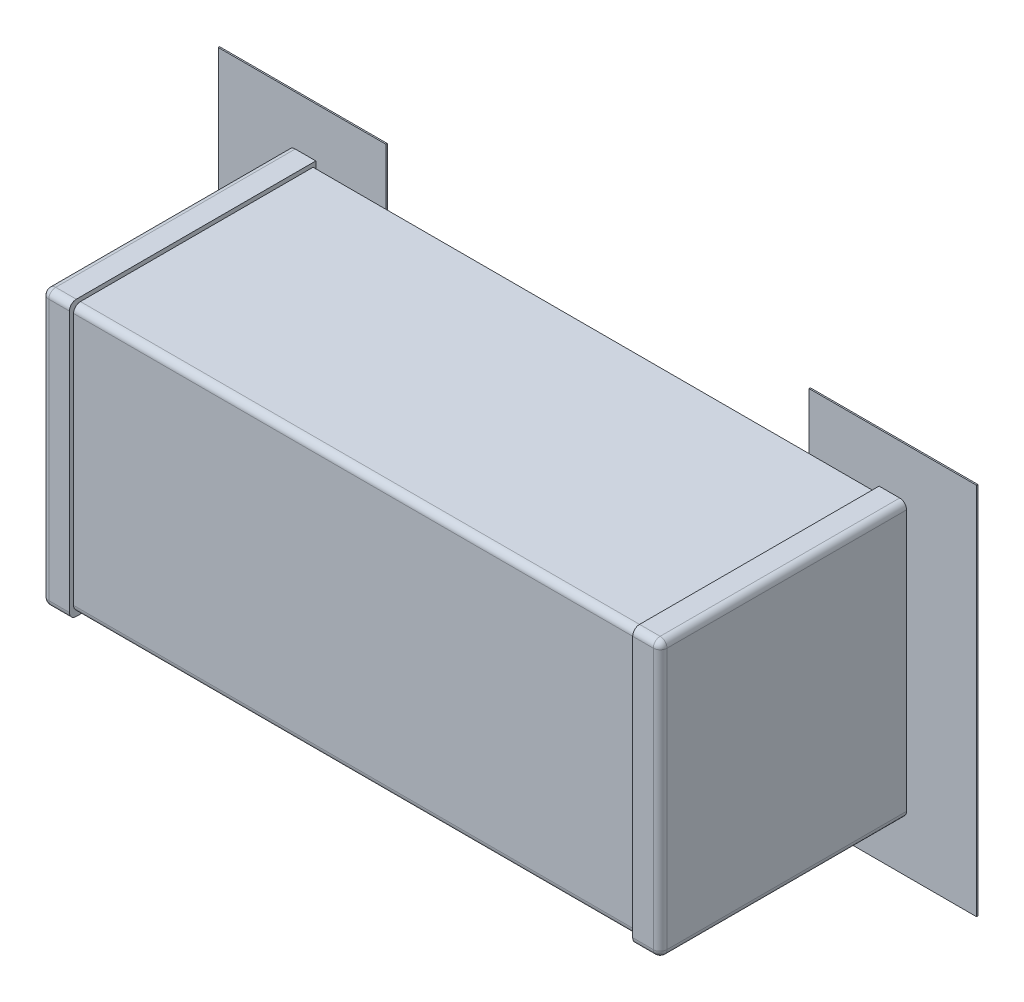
ISO-10303-21;
HEADER;
FILE_DESCRIPTION(('STEP AP214'),'2;1');
FILE_NAME('part.step','',(''),(''),'','','');
FILE_SCHEMA(('AUTOMOTIVE_DESIGN { 1 0 10303 214 1 1 1 1 }'));
ENDSEC;
DATA;
#1=APPLICATION_CONTEXT('core data for automotive mechanical design processes');
#2=APPLICATION_PROTOCOL_DEFINITION('international standard','automotive_design',2000,#1);
#3=PRODUCT_CONTEXT('',#1,'mechanical');
#4=PRODUCT('Part','Part','',(#3));
#5=PRODUCT_RELATED_PRODUCT_CATEGORY('part','',(#4));
#6=PRODUCT_DEFINITION_FORMATION('','',#4);
#7=PRODUCT_DEFINITION_CONTEXT('part definition',#1,'design');
#8=PRODUCT_DEFINITION('design','',#6,#7);
#9=PRODUCT_DEFINITION_SHAPE('','',#8);
#10=(LENGTH_UNIT() NAMED_UNIT(*) SI_UNIT(.MILLI.,.METRE.));
#11=(NAMED_UNIT(*) PLANE_ANGLE_UNIT() SI_UNIT($,.RADIAN.));
#12=(NAMED_UNIT(*) SI_UNIT($,.STERADIAN.) SOLID_ANGLE_UNIT());
#13=UNCERTAINTY_MEASURE_WITH_UNIT(LENGTH_MEASURE(1.E-05),#10,'distance_accuracy_value','');
#14=(GEOMETRIC_REPRESENTATION_CONTEXT(3) GLOBAL_UNCERTAINTY_ASSIGNED_CONTEXT((#13)) GLOBAL_UNIT_ASSIGNED_CONTEXT((#10,
#11,#12)) REPRESENTATION_CONTEXT('',''));
#15=CARTESIAN_POINT('',(0.,0.,0.));
#16=DIRECTION('',(0.,0.,1.));
#17=DIRECTION('',(1.,0.,0.));
#18=AXIS2_PLACEMENT_3D('',#15,#16,#17);
#19=CARTESIAN_POINT('',(0.,0.,0.0762));
#20=DIRECTION('',(0.,0.,1.));
#21=DIRECTION('',(1.,0.,0.));
#22=AXIS2_PLACEMENT_3D('',#19,#20,#21);
#23=PLANE('',#22);
#24=DIRECTION('',(1.,0.,0.));
#25=VECTOR('',#24,1.);
#26=CARTESIAN_POINT('',(2.75999999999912,1.35999999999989,0.0762));
#27=LINE('',#26,#25);
#28=CARTESIAN_POINT('',(2.75999999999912,1.35999999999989,0.0762));
#29=VERTEX_POINT('',#28);
#30=CARTESIAN_POINT('',(1.53999999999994,1.35999999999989,0.0762));
#31=VERTEX_POINT('',#30);
#32=EDGE_CURVE('E735',#29,#31,#27,.F.);
#33=ORIENTED_EDGE('',*,*,#32,.F.);
#34=DIRECTION('',(0.,1.,0.));
#35=VECTOR('',#34,1.);
#36=CARTESIAN_POINT('',(2.75999999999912,-1.35999999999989,0.0762));
#37=LINE('',#36,#35);
#38=CARTESIAN_POINT('',(2.75999999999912,-1.35999999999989,0.0762));
#39=VERTEX_POINT('',#38);
#40=EDGE_CURVE('E573',#39,#29,#37,.T.);
#41=ORIENTED_EDGE('',*,*,#40,.F.);
#42=DIRECTION('',(1.,0.,0.));
#43=VECTOR('',#42,1.);
#44=CARTESIAN_POINT('',(0.,-1.35999999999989,0.0762));
#45=LINE('',#44,#43);
#46=CARTESIAN_POINT('',(1.53999999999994,-1.35999999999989,0.0762));
#47=VERTEX_POINT('',#46);
#48=EDGE_CURVE('E252',#47,#39,#45,.T.);
#49=ORIENTED_EDGE('',*,*,#48,.F.);
#50=DIRECTION('',(0.,1.,0.));
#51=VECTOR('',#50,1.);
#52=CARTESIAN_POINT('',(1.53999999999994,1.35999999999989,0.0762));
#53=LINE('',#52,#51);
#54=EDGE_CURVE('E725',#31,#47,#53,.F.);
#55=ORIENTED_EDGE('',*,*,#54,.F.);
#56=EDGE_LOOP('',(#33,#41,#49,#55));
#57=FACE_BOUND('',#56,.T.);
#58=ADVANCED_FACE('F16',(#57),#23,.F.);
#59=CARTESIAN_POINT('',(0.,0.,0.0762));
#60=DIRECTION('',(0.,0.,1.));
#61=DIRECTION('',(1.,0.,0.));
#62=AXIS2_PLACEMENT_3D('',#59,#60,#61);
#63=PLANE('',#62);
#64=DIRECTION('',(1.,0.,0.));
#65=VECTOR('',#64,1.);
#66=CARTESIAN_POINT('',(-1.53999999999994,1.35999999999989,0.0762));
#67=LINE('',#66,#65);
#68=CARTESIAN_POINT('',(-1.53999999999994,1.35999999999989,0.0762));
#69=VERTEX_POINT('',#68);
#70=CARTESIAN_POINT('',(-2.75999999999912,1.35999999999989,0.0762));
#71=VERTEX_POINT('',#70);
#72=EDGE_CURVE('E256',#69,#71,#67,.F.);
#73=ORIENTED_EDGE('',*,*,#72,.F.);
#74=DIRECTION('',(0.,1.,0.));
#75=VECTOR('',#74,1.);
#76=CARTESIAN_POINT('',(-1.53999999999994,-1.35999999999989,0.0762));
#77=LINE('',#76,#75);
#78=CARTESIAN_POINT('',(-1.53999999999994,-1.35999999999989,0.0762));
#79=VERTEX_POINT('',#78);
#80=EDGE_CURVE('E106',#79,#69,#77,.T.);
#81=ORIENTED_EDGE('',*,*,#80,.F.);
#82=DIRECTION('',(1.,0.,0.));
#83=VECTOR('',#82,1.);
#84=CARTESIAN_POINT('',(0.,-1.35999999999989,0.0762));
#85=LINE('',#84,#83);
#86=CARTESIAN_POINT('',(-2.75999999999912,-1.35999999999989,0.0762));
#87=VERTEX_POINT('',#86);
#88=EDGE_CURVE('E242',#87,#79,#85,.T.);
#89=ORIENTED_EDGE('',*,*,#88,.F.);
#90=DIRECTION('',(0.,1.,0.));
#91=VECTOR('',#90,1.);
#92=CARTESIAN_POINT('',(-2.75999999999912,1.35999999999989,0.0762));
#93=LINE('',#92,#91);
#94=EDGE_CURVE('E263',#71,#87,#93,.F.);
#95=ORIENTED_EDGE('',*,*,#94,.F.);
#96=EDGE_LOOP('',(#73,#81,#89,#95));
#97=FACE_BOUND('',#96,.T.);
#98=ADVANCED_FACE('F255',(#97),#63,.F.);
#99=CARTESIAN_POINT('',(2.20000000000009,0.95000000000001,1.82959999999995));
#100=DIRECTION('',(0.,0.707106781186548,0.707106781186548));
#101=DIRECTION('',(1.,0.,0.));
#102=AXIS2_PLACEMENT_3D('',#99,#100,#101);
#103=SPHERICAL_SURFACE('',#102,0.0500000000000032);
#104=CARTESIAN_POINT('',(2.20000000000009,0.95000000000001,1.82959999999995));
#105=DIRECTION('',(-1.,0.,0.));
#106=DIRECTION('',(0.,0.,1.));
#107=AXIS2_PLACEMENT_3D('',#104,#105,#106);
#108=CIRCLE('',#107,0.0500000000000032);
#109=CARTESIAN_POINT('',(2.20000000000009,0.95000000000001,1.87959999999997));
#110=VERTEX_POINT('',#109);
#111=CARTESIAN_POINT('',(2.20000000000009,0.985355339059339,1.86495533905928));
#112=VERTEX_POINT('',#111);
#113=EDGE_CURVE('E585',#110,#112,#108,.T.);
#114=ORIENTED_EDGE('',*,*,#113,.F.);
#115=CARTESIAN_POINT('',(2.20000000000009,0.95000000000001,1.82959999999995));
#116=DIRECTION('',(0.,1.,0.));
#117=DIRECTION('',(0.,0.,1.));
#118=AXIS2_PLACEMENT_3D('',#115,#116,#117);
#119=CIRCLE('',#118,0.0500000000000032);
#120=CARTESIAN_POINT('',(2.24999999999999,0.95000000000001,1.82959999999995));
#121=VERTEX_POINT('',#120);
#122=EDGE_CURVE('E19',#121,#110,#119,.F.);
#123=ORIENTED_EDGE('',*,*,#122,.F.);
#124=CARTESIAN_POINT('',(2.20000000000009,0.95000000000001,1.82959999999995));
#125=DIRECTION('',(0.,0.,-1.));
#126=DIRECTION('',(-1.,0.,0.));
#127=AXIS2_PLACEMENT_3D('',#124,#125,#126);
#128=CIRCLE('',#127,0.0500000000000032);
#129=CARTESIAN_POINT('',(2.20000000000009,1.00000000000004,1.82959999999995));
#130=VERTEX_POINT('',#129);
#131=EDGE_CURVE('E568',#130,#121,#128,.T.);
#132=ORIENTED_EDGE('',*,*,#131,.F.);
#133=CARTESIAN_POINT('',(2.20000000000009,0.95000000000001,1.82959999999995));
#134=DIRECTION('',(-1.,0.,0.));
#135=DIRECTION('',(0.,0.,1.));
#136=AXIS2_PLACEMENT_3D('',#133,#134,#135);
#137=CIRCLE('',#136,0.0500000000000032);
#138=EDGE_CURVE('E586',#112,#130,#137,.T.);
#139=ORIENTED_EDGE('',*,*,#138,.F.);
#140=EDGE_LOOP('',(#114,#123,#132,#139));
#141=FACE_BOUND('',#140,.T.);
#142=ADVANCED_FACE('F348',(#141),#103,.T.);
#143=CARTESIAN_POINT('',(2.20000000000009,-4.90579199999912,1.82959999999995));
#144=DIRECTION('',(0.,1.,0.));
#145=DIRECTION('',(0.,0.,1.));
#146=AXIS2_PLACEMENT_3D('',#143,#144,#145);
#147=CYLINDRICAL_SURFACE('',#146,0.0500000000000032);
#148=CARTESIAN_POINT('',(2.20000000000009,-0.95000000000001,1.82959999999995));
#149=DIRECTION('',(0.,1.,0.));
#150=DIRECTION('',(0.,0.,1.));
#151=AXIS2_PLACEMENT_3D('',#148,#149,#150);
#152=CIRCLE('',#151,0.0500000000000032);
#153=CARTESIAN_POINT('',(2.24999999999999,-0.95000000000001,1.82959999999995));
#154=VERTEX_POINT('',#153);
#155=CARTESIAN_POINT('',(2.23535533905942,-0.95000000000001,1.86495533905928));
#156=VERTEX_POINT('',#155);
#157=EDGE_CURVE('E345',#154,#156,#152,.F.);
#158=ORIENTED_EDGE('',*,*,#157,.F.);
#159=DIRECTION('',(0.,1.,0.));
#160=VECTOR('',#159,1.);
#161=CARTESIAN_POINT('',(2.24999999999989,-1.00000000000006,1.82959999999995));
#162=LINE('',#161,#160);
#163=EDGE_CURVE('E582',#121,#154,#162,.F.);
#164=ORIENTED_EDGE('',*,*,#163,.F.);
#165=ORIENTED_EDGE('',*,*,#122,.T.);
#166=DIRECTION('',(0.,1.,0.));
#167=VECTOR('',#166,1.);
#168=CARTESIAN_POINT('',(2.20000000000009,0.,1.8796));
#169=LINE('',#168,#167);
#170=CARTESIAN_POINT('',(2.20000000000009,-0.950000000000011,1.87959999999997));
#171=VERTEX_POINT('',#170);
#172=EDGE_CURVE('E340',#171,#110,#169,.T.);
#173=ORIENTED_EDGE('',*,*,#172,.F.);
#174=CARTESIAN_POINT('',(2.20000000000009,-0.95000000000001,1.82959999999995));
#175=DIRECTION('',(0.,-1.,0.));
#176=DIRECTION('',(0.707106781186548,0.,0.707106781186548));
#177=AXIS2_PLACEMENT_3D('',#174,#175,#176);
#178=CIRCLE('',#177,0.0500000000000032);
#179=EDGE_CURVE('E342',#156,#171,#178,.T.);
#180=ORIENTED_EDGE('',*,*,#179,.F.);
#181=EDGE_LOOP('',(#158,#164,#165,#173,#180));
#182=FACE_BOUND('',#181,.T.);
#183=ADVANCED_FACE('F334',(#182),#147,.T.);
#184=CARTESIAN_POINT('',(2.20000000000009,-0.95000000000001,1.82959999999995));
#185=DIRECTION('',(0.707106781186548,0.,0.707106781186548));
#186=DIRECTION('',(0.,-1.,0.));
#187=AXIS2_PLACEMENT_3D('',#184,#185,#186);
#188=SPHERICAL_SURFACE('',#187,0.0500000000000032);
#189=ORIENTED_EDGE('',*,*,#179,.T.);
#190=CARTESIAN_POINT('',(2.20000000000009,-0.95000000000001,1.82959999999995));
#191=DIRECTION('',(1.,0.,0.));
#192=DIRECTION('',(0.,0.,-1.));
#193=AXIS2_PLACEMENT_3D('',#190,#191,#192);
#194=CIRCLE('',#193,0.0500000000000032);
#195=CARTESIAN_POINT('',(2.20000000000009,-1.00000000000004,1.82959999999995));
#196=VERTEX_POINT('',#195);
#197=EDGE_CURVE('E537',#196,#171,#194,.F.);
#198=ORIENTED_EDGE('',*,*,#197,.F.);
#199=CARTESIAN_POINT('',(2.20000000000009,-0.95000000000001,1.82959999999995));
#200=DIRECTION('',(0.,0.,-1.));
#201=DIRECTION('',(-1.,0.,0.));
#202=AXIS2_PLACEMENT_3D('',#199,#200,#201);
#203=CIRCLE('',#202,0.0500000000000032);
#204=EDGE_CURVE('E571',#154,#196,#203,.T.);
#205=ORIENTED_EDGE('',*,*,#204,.F.);
#206=ORIENTED_EDGE('',*,*,#157,.T.);
#207=EDGE_LOOP('',(#189,#198,#205,#206));
#208=FACE_BOUND('',#207,.T.);
#209=ADVANCED_FACE('F329',(#208),#188,.T.);
#210=CARTESIAN_POINT('',(2.20000000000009,-0.95000000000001,4.23051224));
#211=DIRECTION('',(0.,0.,-1.));
#212=DIRECTION('',(-1.,0.,0.));
#213=AXIS2_PLACEMENT_3D('',#210,#211,#212);
#214=CYLINDRICAL_SURFACE('',#213,0.0500000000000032);
#215=ORIENTED_EDGE('',*,*,#204,.T.);
#216=DIRECTION('',(0.,0.,-1.));
#217=VECTOR('',#216,1.);
#218=CARTESIAN_POINT('',(2.20000000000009,-1.00000000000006,0.0762));
#219=LINE('',#218,#217);
#220=CARTESIAN_POINT('',(2.20000000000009,-1.00000000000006,0.0862000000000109));
#221=VERTEX_POINT('',#220);
#222=EDGE_CURVE('E532',#221,#196,#219,.F.);
#223=ORIENTED_EDGE('',*,*,#222,.F.);
#224=CARTESIAN_POINT('',(2.20000000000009,-0.95000000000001,0.0862000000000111));
#225=DIRECTION('',(0.,0.,-1.));
#226=DIRECTION('',(-1.,0.,0.));
#227=AXIS2_PLACEMENT_3D('',#224,#225,#226);
#228=CIRCLE('',#227,0.0500000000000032);
#229=CARTESIAN_POINT('',(2.24999999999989,-0.95000000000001,0.0862000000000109));
#230=VERTEX_POINT('',#229);
#231=EDGE_CURVE('E344',#221,#230,#228,.F.);
#232=ORIENTED_EDGE('',*,*,#231,.T.);
#233=DIRECTION('',(0.,0.,-1.));
#234=VECTOR('',#233,1.);
#235=CARTESIAN_POINT('',(2.24999999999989,-0.95000000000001,0.0762));
#236=LINE('',#235,#234);
#237=EDGE_CURVE('E570',#154,#230,#236,.T.);
#238=ORIENTED_EDGE('',*,*,#237,.F.);
#239=EDGE_LOOP('',(#215,#223,#232,#238));
#240=FACE_BOUND('',#239,.T.);
#241=ADVANCED_FACE('F325',(#240),#214,.T.);
#242=CARTESIAN_POINT('',(2.75999999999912,-1.35999999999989,0.0762));
#243=DIRECTION('',(1.,0.,0.));
#244=DIRECTION('',(0.,0.,-1.));
#245=AXIS2_PLACEMENT_3D('',#242,#243,#244);
#246=PLANE('',#245);
#247=DIRECTION('',(0.,0.,-1.));
#248=VECTOR('',#247,1.);
#249=CARTESIAN_POINT('',(2.75999999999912,-1.35999999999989,0.0762));
#250=LINE('',#249,#248);
#251=CARTESIAN_POINT('',(2.75999999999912,-1.35999999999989,0.0862000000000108));
#252=VERTEX_POINT('',#251);
#253=EDGE_CURVE('E721',#39,#252,#250,.F.);
#254=ORIENTED_EDGE('',*,*,#253,.F.);
#255=ORIENTED_EDGE('',*,*,#40,.T.);
#256=DIRECTION('',(0.,0.,1.));
#257=VECTOR('',#256,1.);
#258=CARTESIAN_POINT('',(2.75999999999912,1.35999999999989,0.0762));
#259=LINE('',#258,#257);
#260=CARTESIAN_POINT('',(2.75999999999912,1.35999999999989,0.0862000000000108));
#261=VERTEX_POINT('',#260);
#262=EDGE_CURVE('E737',#261,#29,#259,.F.);
#263=ORIENTED_EDGE('',*,*,#262,.F.);
#264=DIRECTION('',(0.,1.,0.));
#265=VECTOR('',#264,1.);
#266=CARTESIAN_POINT('',(2.75999999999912,0.,0.0862000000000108));
#267=LINE('',#266,#265);
#268=EDGE_CURVE('E530',#252,#261,#267,.T.);
#269=ORIENTED_EDGE('',*,*,#268,.F.);
#270=EDGE_LOOP('',(#254,#255,#263,#269));
#271=FACE_BOUND('',#270,.T.);
#272=ADVANCED_FACE('F321',(#271),#246,.T.);
#273=CARTESIAN_POINT('',(2.75999999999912,1.35999999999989,0.0762));
#274=DIRECTION('',(0.,1.,0.));
#275=DIRECTION('',(0.,0.,1.));
#276=AXIS2_PLACEMENT_3D('',#273,#274,#275);
#277=PLANE('',#276);
#278=ORIENTED_EDGE('',*,*,#262,.T.);
#279=ORIENTED_EDGE('',*,*,#32,.T.);
#280=DIRECTION('',(0.,0.,1.));
#281=VECTOR('',#280,1.);
#282=CARTESIAN_POINT('',(1.53999999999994,1.35999999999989,0.0762));
#283=LINE('',#282,#281);
#284=CARTESIAN_POINT('',(1.53999999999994,1.35999999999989,0.0862000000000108));
#285=VERTEX_POINT('',#284);
#286=EDGE_CURVE('E732',#285,#31,#283,.F.);
#287=ORIENTED_EDGE('',*,*,#286,.F.);
#288=DIRECTION('',(1.,0.,0.));
#289=VECTOR('',#288,1.);
#290=CARTESIAN_POINT('',(0.,1.35999999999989,0.0862000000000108));
#291=LINE('',#290,#289);
#292=EDGE_CURVE('E528',#261,#285,#291,.F.);
#293=ORIENTED_EDGE('',*,*,#292,.F.);
#294=EDGE_LOOP('',(#278,#279,#287,#293));
#295=FACE_BOUND('',#294,.T.);
#296=ADVANCED_FACE('F317',(#295),#277,.T.);
#297=CARTESIAN_POINT('',(1.53999999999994,1.35999999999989,0.0762));
#298=DIRECTION('',(-1.,0.,0.));
#299=DIRECTION('',(0.,0.,1.));
#300=AXIS2_PLACEMENT_3D('',#297,#298,#299);
#301=PLANE('',#300);
#302=ORIENTED_EDGE('',*,*,#286,.T.);
#303=ORIENTED_EDGE('',*,*,#54,.T.);
#304=DIRECTION('',(0.,0.,-1.));
#305=VECTOR('',#304,1.);
#306=CARTESIAN_POINT('',(1.53999999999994,-1.35999999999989,0.0762));
#307=LINE('',#306,#305);
#308=CARTESIAN_POINT('',(1.53999999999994,-1.35999999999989,0.0862000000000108));
#309=VERTEX_POINT('',#308);
#310=EDGE_CURVE('E717',#309,#47,#307,.T.);
#311=ORIENTED_EDGE('',*,*,#310,.F.);
#312=DIRECTION('',(0.,1.,0.));
#313=VECTOR('',#312,1.);
#314=CARTESIAN_POINT('',(1.53999999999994,0.,0.0862000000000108));
#315=LINE('',#314,#313);
#316=EDGE_CURVE('E526',#285,#309,#315,.F.);
#317=ORIENTED_EDGE('',*,*,#316,.F.);
#318=EDGE_LOOP('',(#302,#303,#311,#317));
#319=FACE_BOUND('',#318,.T.);
#320=ADVANCED_FACE('F313',(#319),#301,.T.);
#321=CARTESIAN_POINT('',(1.53999999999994,-1.35999999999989,0.0762));
#322=DIRECTION('',(0.,-1.,0.));
#323=DIRECTION('',(0.,0.,-1.));
#324=AXIS2_PLACEMENT_3D('',#321,#322,#323);
#325=PLANE('',#324);
#326=ORIENTED_EDGE('',*,*,#310,.T.);
#327=ORIENTED_EDGE('',*,*,#48,.T.);
#328=ORIENTED_EDGE('',*,*,#253,.T.);
#329=DIRECTION('',(1.,0.,0.));
#330=VECTOR('',#329,1.);
#331=CARTESIAN_POINT('',(0.,-1.35999999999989,0.0862000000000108));
#332=LINE('',#331,#330);
#333=EDGE_CURVE('E521',#309,#252,#332,.T.);
#334=ORIENTED_EDGE('',*,*,#333,.F.);
#335=EDGE_LOOP('',(#326,#327,#328,#334));
#336=FACE_BOUND('',#335,.T.);
#337=ADVANCED_FACE('F309',(#336),#325,.T.);
#338=CARTESIAN_POINT('',(2.24999999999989,-1.00000000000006,0.0762));
#339=DIRECTION('',(1.,0.,0.));
#340=DIRECTION('',(0.,0.,-1.));
#341=AXIS2_PLACEMENT_3D('',#338,#339,#340);
#342=PLANE('',#341);
#343=DIRECTION('',(0.,1.,0.));
#344=VECTOR('',#343,1.);
#345=CARTESIAN_POINT('',(2.24999999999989,0.,0.0862000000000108));
#346=LINE('',#345,#344);
#347=CARTESIAN_POINT('',(2.24999999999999,0.95000000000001,0.0862000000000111));
#348=VERTEX_POINT('',#347);
#349=EDGE_CURVE('E515',#348,#230,#346,.F.);
#350=ORIENTED_EDGE('',*,*,#349,.F.);
#351=DIRECTION('',(0.,0.,-1.));
#352=VECTOR('',#351,1.);
#353=CARTESIAN_POINT('',(2.25000000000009,0.95000000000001,4.23051224));
#354=LINE('',#353,#352);
#355=EDGE_CURVE('E567',#121,#348,#354,.T.);
#356=ORIENTED_EDGE('',*,*,#355,.F.);
#357=ORIENTED_EDGE('',*,*,#163,.T.);
#358=ORIENTED_EDGE('',*,*,#237,.T.);
#359=EDGE_LOOP('',(#350,#356,#357,#358));
#360=FACE_BOUND('',#359,.T.);
#361=ADVANCED_FACE('F305',(#360),#342,.T.);
#362=CARTESIAN_POINT('',(2.20000000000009,0.95000000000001,4.23051224));
#363=DIRECTION('',(0.,0.,-1.));
#364=DIRECTION('',(-1.,0.,0.));
#365=AXIS2_PLACEMENT_3D('',#362,#363,#364);
#366=CYLINDRICAL_SURFACE('',#365,0.0500000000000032);
#367=ORIENTED_EDGE('',*,*,#131,.T.);
#368=ORIENTED_EDGE('',*,*,#355,.T.);
#369=CARTESIAN_POINT('',(2.20000000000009,0.95000000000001,0.0862000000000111));
#370=DIRECTION('',(0.,0.,-1.));
#371=DIRECTION('',(-1.,0.,0.));
#372=AXIS2_PLACEMENT_3D('',#369,#370,#371);
#373=CIRCLE('',#372,0.0500000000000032);
#374=CARTESIAN_POINT('',(2.20000000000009,1.00000000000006,0.0862000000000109));
#375=VERTEX_POINT('',#374);
#376=EDGE_CURVE('E518',#375,#348,#373,.T.);
#377=ORIENTED_EDGE('',*,*,#376,.F.);
#378=DIRECTION('',(0.,0.,1.));
#379=VECTOR('',#378,1.);
#380=CARTESIAN_POINT('',(2.20000000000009,1.00000000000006,0.0762));
#381=LINE('',#380,#379);
#382=EDGE_CURVE('E505',#130,#375,#381,.F.);
#383=ORIENTED_EDGE('',*,*,#382,.F.);
#384=EDGE_LOOP('',(#367,#368,#377,#383));
#385=FACE_BOUND('',#384,.T.);
#386=ADVANCED_FACE('F301',(#385),#366,.T.);
#387=CARTESIAN_POINT('',(-2.20000000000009,-0.95000000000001,1.82959999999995));
#388=DIRECTION('',(0.,-0.707106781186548,0.707106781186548));
#389=DIRECTION('',(-1.,0.,0.));
#390=AXIS2_PLACEMENT_3D('',#387,#388,#389);
#391=SPHERICAL_SURFACE('',#390,0.0500000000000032);
#392=CARTESIAN_POINT('',(-2.20000000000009,-0.95000000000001,1.82959999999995));
#393=DIRECTION('',(1.,0.,0.));
#394=DIRECTION('',(0.,0.,-1.));
#395=AXIS2_PLACEMENT_3D('',#392,#393,#394);
#396=CIRCLE('',#395,0.0500000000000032);
#397=CARTESIAN_POINT('',(-2.20000000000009,-0.95000000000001,1.87959999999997));
#398=VERTEX_POINT('',#397);
#399=CARTESIAN_POINT('',(-2.20000000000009,-0.985355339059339,1.86495533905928));
#400=VERTEX_POINT('',#399);
#401=EDGE_CURVE('E540',#398,#400,#396,.T.);
#402=ORIENTED_EDGE('',*,*,#401,.F.);
#403=CARTESIAN_POINT('',(-2.20000000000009,-0.95000000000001,1.82959999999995));
#404=DIRECTION('',(0.,-1.,0.));
#405=DIRECTION('',(0.,0.,-1.));
#406=AXIS2_PLACEMENT_3D('',#403,#404,#405);
#407=CIRCLE('',#406,0.0500000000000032);
#408=CARTESIAN_POINT('',(-2.24999999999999,-0.95000000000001,1.82959999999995));
#409=VERTEX_POINT('',#408);
#410=EDGE_CURVE('E565',#409,#398,#407,.F.);
#411=ORIENTED_EDGE('',*,*,#410,.F.);
#412=CARTESIAN_POINT('',(-2.20000000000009,-0.95000000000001,1.82959999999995));
#413=DIRECTION('',(0.,0.,-1.));
#414=DIRECTION('',(-1.,0.,0.));
#415=AXIS2_PLACEMENT_3D('',#412,#413,#414);
#416=CIRCLE('',#415,0.0500000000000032);
#417=CARTESIAN_POINT('',(-2.20000000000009,-1.00000000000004,1.82959999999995));
#418=VERTEX_POINT('',#417);
#419=EDGE_CURVE('E549',#418,#409,#416,.T.);
#420=ORIENTED_EDGE('',*,*,#419,.F.);
#421=CARTESIAN_POINT('',(-2.20000000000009,-0.95000000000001,1.82959999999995));
#422=DIRECTION('',(1.,0.,0.));
#423=DIRECTION('',(0.,0.,-1.));
#424=AXIS2_PLACEMENT_3D('',#421,#422,#423);
#425=CIRCLE('',#424,0.0500000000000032);
#426=EDGE_CURVE('E281',#400,#418,#425,.T.);
#427=ORIENTED_EDGE('',*,*,#426,.F.);
#428=EDGE_LOOP('',(#402,#411,#420,#427));
#429=FACE_BOUND('',#428,.T.);
#430=ADVANCED_FACE('F297',(#429),#391,.T.);
#431=CARTESIAN_POINT('',(-2.20000000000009,4.90579199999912,1.82959999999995));
#432=DIRECTION('',(0.,-1.,0.));
#433=DIRECTION('',(0.,0.,-1.));
#434=AXIS2_PLACEMENT_3D('',#431,#432,#433);
#435=CYLINDRICAL_SURFACE('',#434,0.0500000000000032);
#436=CARTESIAN_POINT('',(-2.20000000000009,0.95000000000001,1.82959999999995));
#437=DIRECTION('',(0.,-1.,0.));
#438=DIRECTION('',(0.,0.,-1.));
#439=AXIS2_PLACEMENT_3D('',#436,#437,#438);
#440=CIRCLE('',#439,0.0500000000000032);
#441=CARTESIAN_POINT('',(-2.24999999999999,0.95000000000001,1.82959999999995));
#442=VERTEX_POINT('',#441);
#443=CARTESIAN_POINT('',(-2.20000000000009,0.95000000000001,1.87959999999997));
#444=VERTEX_POINT('',#443);
#445=EDGE_CURVE('E469',#442,#444,#440,.F.);
#446=ORIENTED_EDGE('',*,*,#445,.F.);
#447=DIRECTION('',(0.,1.,0.));
#448=VECTOR('',#447,1.);
#449=CARTESIAN_POINT('',(-2.24999999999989,1.00000000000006,1.82959999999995));
#450=LINE('',#449,#448);
#451=EDGE_CURVE('E265',#409,#442,#450,.T.);
#452=ORIENTED_EDGE('',*,*,#451,.F.);
#453=ORIENTED_EDGE('',*,*,#410,.T.);
#454=DIRECTION('',(0.,1.,0.));
#455=VECTOR('',#454,1.);
#456=CARTESIAN_POINT('',(-2.20000000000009,0.,1.8796));
#457=LINE('',#456,#455);
#458=EDGE_CURVE('E277',#444,#398,#457,.F.);
#459=ORIENTED_EDGE('',*,*,#458,.F.);
#460=EDGE_LOOP('',(#446,#452,#453,#459));
#461=FACE_BOUND('',#460,.T.);
#462=ADVANCED_FACE('F292',(#461),#435,.T.);
#463=CARTESIAN_POINT('',(-2.20000000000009,0.95000000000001,1.82959999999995));
#464=DIRECTION('',(-0.707106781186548,0.707106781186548,0.));
#465=DIRECTION('',(0.,0.,1.));
#466=AXIS2_PLACEMENT_3D('',#463,#464,#465);
#467=SPHERICAL_SURFACE('',#466,0.0500000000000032);
#468=ORIENTED_EDGE('',*,*,#445,.T.);
#469=CARTESIAN_POINT('',(-2.20000000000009,0.95000000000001,1.82959999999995));
#470=DIRECTION('',(-1.,0.,0.));
#471=DIRECTION('',(0.,0.,1.));
#472=AXIS2_PLACEMENT_3D('',#469,#470,#471);
#473=CIRCLE('',#472,0.0500000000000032);
#474=CARTESIAN_POINT('',(-2.20000000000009,1.00000000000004,1.82959999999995));
#475=VERTEX_POINT('',#474);
#476=EDGE_CURVE('E468',#475,#444,#473,.F.);
#477=ORIENTED_EDGE('',*,*,#476,.F.);
#478=CARTESIAN_POINT('',(-2.20000000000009,0.95000000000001,1.82959999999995));
#479=DIRECTION('',(0.,0.,-1.));
#480=DIRECTION('',(-1.,0.,0.));
#481=AXIS2_PLACEMENT_3D('',#478,#479,#480);
#482=CIRCLE('',#481,0.0500000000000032);
#483=CARTESIAN_POINT('',(-2.23535533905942,0.985355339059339,1.82959999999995));
#484=VERTEX_POINT('',#483);
#485=EDGE_CURVE('E258',#484,#475,#482,.T.);
#486=ORIENTED_EDGE('',*,*,#485,.F.);
#487=CARTESIAN_POINT('',(-2.20000000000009,0.95000000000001,1.82959999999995));
#488=DIRECTION('',(0.,0.,-1.));
#489=DIRECTION('',(-1.,0.,0.));
#490=AXIS2_PLACEMENT_3D('',#487,#488,#489);
#491=CIRCLE('',#490,0.0500000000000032);
#492=EDGE_CURVE('E34',#442,#484,#491,.T.);
#493=ORIENTED_EDGE('',*,*,#492,.F.);
#494=EDGE_LOOP('',(#468,#477,#486,#493));
#495=FACE_BOUND('',#494,.T.);
#496=ADVANCED_FACE('F287',(#495),#467,.T.);
#497=CARTESIAN_POINT('',(-2.20000000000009,0.95000000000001,4.23051224));
#498=DIRECTION('',(0.,0.,-1.));
#499=DIRECTION('',(-1.,0.,0.));
#500=AXIS2_PLACEMENT_3D('',#497,#498,#499);
#501=CYLINDRICAL_SURFACE('',#500,0.0500000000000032);
#502=ORIENTED_EDGE('',*,*,#485,.T.);
#503=DIRECTION('',(0.,0.,1.));
#504=VECTOR('',#503,1.);
#505=CARTESIAN_POINT('',(-2.20000000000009,1.00000000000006,0.0762));
#506=LINE('',#505,#504);
#507=CARTESIAN_POINT('',(-2.20000000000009,1.00000000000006,0.0862000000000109));
#508=VERTEX_POINT('',#507);
#509=EDGE_CURVE('E464',#508,#475,#506,.T.);
#510=ORIENTED_EDGE('',*,*,#509,.F.);
#511=CARTESIAN_POINT('',(-2.20000000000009,0.95000000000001,0.0862000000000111));
#512=DIRECTION('',(0.,0.,-1.));
#513=DIRECTION('',(-1.,0.,0.));
#514=AXIS2_PLACEMENT_3D('',#511,#512,#513);
#515=CIRCLE('',#514,0.0500000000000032);
#516=CARTESIAN_POINT('',(-2.24999999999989,0.95000000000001,0.0862000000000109));
#517=VERTEX_POINT('',#516);
#518=EDGE_CURVE('E276',#508,#517,#515,.F.);
#519=ORIENTED_EDGE('',*,*,#518,.T.);
#520=DIRECTION('',(0.,0.,1.));
#521=VECTOR('',#520,1.);
#522=CARTESIAN_POINT('',(-2.24999999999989,0.95000000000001,0.0762));
#523=LINE('',#522,#521);
#524=EDGE_CURVE('E546',#442,#517,#523,.F.);
#525=ORIENTED_EDGE('',*,*,#524,.F.);
#526=ORIENTED_EDGE('',*,*,#492,.T.);
#527=EDGE_LOOP('',(#502,#510,#519,#525,#526));
#528=FACE_BOUND('',#527,.T.);
#529=ADVANCED_FACE('F291',(#528),#501,.T.);
#530=CARTESIAN_POINT('',(-1.53999999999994,-1.35999999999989,0.0762));
#531=DIRECTION('',(1.,0.,0.));
#532=DIRECTION('',(0.,0.,-1.));
#533=AXIS2_PLACEMENT_3D('',#530,#531,#532);
#534=PLANE('',#533);
#535=DIRECTION('',(0.,0.,-1.));
#536=VECTOR('',#535,1.);
#537=CARTESIAN_POINT('',(-1.53999999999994,-1.35999999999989,0.0762));
#538=LINE('',#537,#536);
#539=CARTESIAN_POINT('',(-1.53999999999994,-1.35999999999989,0.0862000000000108));
#540=VERTEX_POINT('',#539);
#541=EDGE_CURVE('E245',#79,#540,#538,.F.);
#542=ORIENTED_EDGE('',*,*,#541,.F.);
#543=ORIENTED_EDGE('',*,*,#80,.T.);
#544=DIRECTION('',(0.,0.,1.));
#545=VECTOR('',#544,1.);
#546=CARTESIAN_POINT('',(-1.53999999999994,1.35999999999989,0.0762));
#547=LINE('',#546,#545);
#548=CARTESIAN_POINT('',(-1.53999999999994,1.35999999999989,0.0862000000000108));
#549=VERTEX_POINT('',#548);
#550=EDGE_CURVE('E257',#549,#69,#547,.F.);
#551=ORIENTED_EDGE('',*,*,#550,.F.);
#552=DIRECTION('',(0.,1.,0.));
#553=VECTOR('',#552,1.);
#554=CARTESIAN_POINT('',(-1.53999999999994,0.,0.0862000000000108));
#555=LINE('',#554,#553);
#556=EDGE_CURVE('E262',#540,#549,#555,.T.);
#557=ORIENTED_EDGE('',*,*,#556,.F.);
#558=EDGE_LOOP('',(#542,#543,#551,#557));
#559=FACE_BOUND('',#558,.T.);
#560=ADVANCED_FACE('F261',(#559),#534,.T.);
#561=CARTESIAN_POINT('',(-1.53999999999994,1.35999999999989,0.0762));
#562=DIRECTION('',(0.,1.,0.));
#563=DIRECTION('',(0.,0.,1.));
#564=AXIS2_PLACEMENT_3D('',#561,#562,#563);
#565=PLANE('',#564);
#566=ORIENTED_EDGE('',*,*,#550,.T.);
#567=ORIENTED_EDGE('',*,*,#72,.T.);
#568=DIRECTION('',(0.,0.,1.));
#569=VECTOR('',#568,1.);
#570=CARTESIAN_POINT('',(-2.75999999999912,1.35999999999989,0.0762));
#571=LINE('',#570,#569);
#572=CARTESIAN_POINT('',(-2.75999999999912,1.35999999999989,0.0862000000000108));
#573=VERTEX_POINT('',#572);
#574=EDGE_CURVE('E267',#573,#71,#571,.F.);
#575=ORIENTED_EDGE('',*,*,#574,.F.);
#576=DIRECTION('',(1.,0.,0.));
#577=VECTOR('',#576,1.);
#578=CARTESIAN_POINT('',(0.,1.35999999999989,0.0862000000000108));
#579=LINE('',#578,#577);
#580=EDGE_CURVE('E676',#549,#573,#579,.F.);
#581=ORIENTED_EDGE('',*,*,#580,.F.);
#582=EDGE_LOOP('',(#566,#567,#575,#581));
#583=FACE_BOUND('',#582,.T.);
#584=ADVANCED_FACE('F451',(#583),#565,.T.);
#585=CARTESIAN_POINT('',(-2.75999999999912,1.35999999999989,0.0762));
#586=DIRECTION('',(-1.,0.,0.));
#587=DIRECTION('',(0.,0.,1.));
#588=AXIS2_PLACEMENT_3D('',#585,#586,#587);
#589=PLANE('',#588);
#590=ORIENTED_EDGE('',*,*,#574,.T.);
#591=ORIENTED_EDGE('',*,*,#94,.T.);
#592=DIRECTION('',(0.,0.,-1.));
#593=VECTOR('',#592,1.);
#594=CARTESIAN_POINT('',(-2.75999999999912,-1.35999999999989,0.0762));
#595=LINE('',#594,#593);
#596=CARTESIAN_POINT('',(-2.75999999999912,-1.35999999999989,0.0862000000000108));
#597=VERTEX_POINT('',#596);
#598=EDGE_CURVE('E248',#597,#87,#595,.T.);
#599=ORIENTED_EDGE('',*,*,#598,.F.);
#600=DIRECTION('',(0.,1.,0.));
#601=VECTOR('',#600,1.);
#602=CARTESIAN_POINT('',(-2.75999999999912,0.,0.0862000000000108));
#603=LINE('',#602,#601);
#604=EDGE_CURVE('E675',#573,#597,#603,.F.);
#605=ORIENTED_EDGE('',*,*,#604,.F.);
#606=EDGE_LOOP('',(#590,#591,#599,#605));
#607=FACE_BOUND('',#606,.T.);
#608=ADVANCED_FACE('F448',(#607),#589,.T.);
#609=CARTESIAN_POINT('',(-2.75999999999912,-1.35999999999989,0.0762));
#610=DIRECTION('',(0.,-1.,0.));
#611=DIRECTION('',(0.,0.,-1.));
#612=AXIS2_PLACEMENT_3D('',#609,#610,#611);
#613=PLANE('',#612);
#614=ORIENTED_EDGE('',*,*,#598,.T.);
#615=ORIENTED_EDGE('',*,*,#88,.T.);
#616=ORIENTED_EDGE('',*,*,#541,.T.);
#617=DIRECTION('',(1.,0.,0.));
#618=VECTOR('',#617,1.);
#619=CARTESIAN_POINT('',(0.,-1.35999999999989,0.0862000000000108));
#620=LINE('',#619,#618);
#621=EDGE_CURVE('E671',#597,#540,#620,.T.);
#622=ORIENTED_EDGE('',*,*,#621,.F.);
#623=EDGE_LOOP('',(#614,#615,#616,#622));
#624=FACE_BOUND('',#623,.T.);
#625=ADVANCED_FACE('F243',(#624),#613,.T.);
#626=CARTESIAN_POINT('',(-2.24999999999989,1.00000000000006,0.0762));
#627=DIRECTION('',(-1.,0.,0.));
#628=DIRECTION('',(0.,0.,1.));
#629=AXIS2_PLACEMENT_3D('',#626,#627,#628);
#630=PLANE('',#629);
#631=DIRECTION('',(0.,1.,0.));
#632=VECTOR('',#631,1.);
#633=CARTESIAN_POINT('',(-2.24999999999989,0.,0.0862000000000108));
#634=LINE('',#633,#632);
#635=CARTESIAN_POINT('',(-2.24999999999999,-0.95000000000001,0.0862000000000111));
#636=VERTEX_POINT('',#635);
#637=EDGE_CURVE('E545',#636,#517,#634,.T.);
#638=ORIENTED_EDGE('',*,*,#637,.F.);
#639=DIRECTION('',(0.,0.,-1.));
#640=VECTOR('',#639,1.);
#641=CARTESIAN_POINT('',(-2.25000000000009,-0.95000000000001,4.23051224));
#642=LINE('',#641,#640);
#643=EDGE_CURVE('E550',#409,#636,#642,.T.);
#644=ORIENTED_EDGE('',*,*,#643,.F.);
#645=ORIENTED_EDGE('',*,*,#451,.T.);
#646=ORIENTED_EDGE('',*,*,#524,.T.);
#647=EDGE_LOOP('',(#638,#644,#645,#646));
#648=FACE_BOUND('',#647,.T.);
#649=ADVANCED_FACE('F441',(#648),#630,.T.);
#650=CARTESIAN_POINT('',(-2.20000000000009,-0.95000000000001,4.23051224));
#651=DIRECTION('',(0.,0.,-1.));
#652=DIRECTION('',(-1.,0.,0.));
#653=AXIS2_PLACEMENT_3D('',#650,#651,#652);
#654=CYLINDRICAL_SURFACE('',#653,0.0500000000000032);
#655=ORIENTED_EDGE('',*,*,#419,.T.);
#656=ORIENTED_EDGE('',*,*,#643,.T.);
#657=CARTESIAN_POINT('',(-2.20000000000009,-0.95000000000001,0.0862000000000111));
#658=DIRECTION('',(0.,0.,-1.));
#659=DIRECTION('',(-1.,0.,0.));
#660=AXIS2_PLACEMENT_3D('',#657,#658,#659);
#661=CIRCLE('',#660,0.0500000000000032);
#662=CARTESIAN_POINT('',(-2.20000000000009,-1.00000000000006,0.0862000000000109));
#663=VERTEX_POINT('',#662);
#664=EDGE_CURVE('E606',#663,#636,#661,.T.);
#665=ORIENTED_EDGE('',*,*,#664,.F.);
#666=DIRECTION('',(0.,0.,-1.));
#667=VECTOR('',#666,1.);
#668=CARTESIAN_POINT('',(-2.20000000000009,-1.00000000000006,0.0762));
#669=LINE('',#668,#667);
#670=EDGE_CURVE('E542',#418,#663,#669,.T.);
#671=ORIENTED_EDGE('',*,*,#670,.F.);
#672=EDGE_LOOP('',(#655,#656,#665,#671));
#673=FACE_BOUND('',#672,.T.);
#674=ADVANCED_FACE('F438',(#673),#654,.T.);
#675=CARTESIAN_POINT('',(9.95587199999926,-0.919999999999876,1.79960000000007));
#676=DIRECTION('',(-1.,0.,0.));
#677=DIRECTION('',(0.,0.,1.));
#678=AXIS2_PLACEMENT_3D('',#675,#676,#677);
#679=CYLINDRICAL_SURFACE('',#678,0.0500000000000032);
#680=CARTESIAN_POINT('',(2.04999999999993,-0.919999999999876,1.79960000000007));
#681=DIRECTION('',(-1.,0.,0.));
#682=DIRECTION('',(0.,0.,1.));
#683=AXIS2_PLACEMENT_3D('',#680,#681,#682);
#684=CIRCLE('',#683,0.0500000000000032);
#685=CARTESIAN_POINT('',(2.04999999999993,-0.96999999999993,1.79960000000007));
#686=VERTEX_POINT('',#685);
#687=CARTESIAN_POINT('',(2.04999999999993,-0.919999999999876,1.84960000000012));
#688=VERTEX_POINT('',#687);
#689=EDGE_CURVE('E555',#686,#688,#684,.T.);
#690=ORIENTED_EDGE('',*,*,#689,.T.);
#691=DIRECTION('',(-1.,0.,0.));
#692=VECTOR('',#691,1.);
#693=CARTESIAN_POINT('',(-2.04999999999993,-0.919999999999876,1.84960000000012));
#694=LINE('',#693,#692);
#695=CARTESIAN_POINT('',(-2.04999999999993,-0.919999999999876,1.84960000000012));
#696=VERTEX_POINT('',#695);
#697=EDGE_CURVE('E616',#688,#696,#694,.T.);
#698=ORIENTED_EDGE('',*,*,#697,.T.);
#699=CARTESIAN_POINT('',(-2.04999999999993,-0.919999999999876,1.79960000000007));
#700=DIRECTION('',(-1.,0.,0.));
#701=DIRECTION('',(0.,0.,1.));
#702=AXIS2_PLACEMENT_3D('',#699,#700,#701);
#703=CIRCLE('',#702,0.0500000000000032);
#704=CARTESIAN_POINT('',(-2.04999999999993,-0.96999999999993,1.79960000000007));
#705=VERTEX_POINT('',#704);
#706=EDGE_CURVE('E195',#696,#705,#703,.F.);
#707=ORIENTED_EDGE('',*,*,#706,.T.);
#708=DIRECTION('',(1.,0.,0.));
#709=VECTOR('',#708,1.);
#710=CARTESIAN_POINT('',(-2.04999999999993,-0.96999999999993,1.79960000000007));
#711=LINE('',#710,#709);
#712=EDGE_CURVE('E597',#705,#686,#711,.T.);
#713=ORIENTED_EDGE('',*,*,#712,.T.);
#714=EDGE_LOOP('',(#690,#698,#707,#713));
#715=FACE_BOUND('',#714,.T.);
#716=ADVANCED_FACE('F434',(#715),#679,.T.);
#717=CARTESIAN_POINT('',(9.95587199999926,0.95000000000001,1.82959999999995));
#718=DIRECTION('',(-1.,0.,0.));
#719=DIRECTION('',(0.,0.,1.));
#720=AXIS2_PLACEMENT_3D('',#717,#718,#719);
#721=CYLINDRICAL_SURFACE('',#720,0.0500000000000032);
#722=DIRECTION('',(1.,0.,0.));
#723=VECTOR('',#722,1.);
#724=CARTESIAN_POINT('',(2.24999999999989,1.00000000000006,1.82959999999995));
#725=LINE('',#724,#723);
#726=CARTESIAN_POINT('',(2.04999999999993,1.00000000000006,1.82959999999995));
#727=VERTEX_POINT('',#726);
#728=EDGE_CURVE('E499',#727,#130,#725,.T.);
#729=ORIENTED_EDGE('',*,*,#728,.F.);
#730=CARTESIAN_POINT('',(2.04999999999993,0.95000000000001,1.82959999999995));
#731=DIRECTION('',(-1.,0.,0.));
#732=DIRECTION('',(0.,0.,1.));
#733=AXIS2_PLACEMENT_3D('',#730,#731,#732);
#734=CIRCLE('',#733,0.0500000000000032);
#735=CARTESIAN_POINT('',(2.04999999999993,0.95000000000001,1.8796));
#736=VERTEX_POINT('',#735);
#737=EDGE_CURVE('E592',#727,#736,#734,.F.);
#738=ORIENTED_EDGE('',*,*,#737,.T.);
#739=DIRECTION('',(1.,0.,0.));
#740=VECTOR('',#739,1.);
#741=CARTESIAN_POINT('',(0.,0.95000000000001,1.8796));
#742=LINE('',#741,#740);
#743=EDGE_CURVE('E538',#110,#736,#742,.F.);
#744=ORIENTED_EDGE('',*,*,#743,.F.);
#745=ORIENTED_EDGE('',*,*,#113,.T.);
#746=ORIENTED_EDGE('',*,*,#138,.T.);
#747=EDGE_LOOP('',(#729,#738,#744,#745,#746));
#748=FACE_BOUND('',#747,.T.);
#749=ADVANCED_FACE('F430',(#748),#721,.T.);
#750=CARTESIAN_POINT('',(0.,0.,1.8796));
#751=DIRECTION('',(0.,0.,1.));
#752=DIRECTION('',(1.,0.,0.));
#753=AXIS2_PLACEMENT_3D('',#750,#751,#752);
#754=PLANE('',#753);
#755=ORIENTED_EDGE('',*,*,#172,.T.);
#756=ORIENTED_EDGE('',*,*,#743,.T.);
#757=DIRECTION('',(0.,1.,0.));
#758=VECTOR('',#757,1.);
#759=CARTESIAN_POINT('',(2.04999999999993,-1.00000000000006,1.8796));
#760=LINE('',#759,#758);
#761=CARTESIAN_POINT('',(2.04999999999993,-0.95000000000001,1.87959999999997));
#762=VERTEX_POINT('',#761);
#763=EDGE_CURVE('E596',#736,#762,#760,.F.);
#764=ORIENTED_EDGE('',*,*,#763,.T.);
#765=DIRECTION('',(1.,0.,0.));
#766=VECTOR('',#765,1.);
#767=CARTESIAN_POINT('',(-9.95587199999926,-0.95000000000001,1.87959999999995));
#768=LINE('',#767,#766);
#769=EDGE_CURVE('E535',#171,#762,#768,.F.);
#770=ORIENTED_EDGE('',*,*,#769,.F.);
#771=EDGE_LOOP('',(#755,#756,#764,#770));
#772=FACE_BOUND('',#771,.T.);
#773=ADVANCED_FACE('F426',(#772),#754,.T.);
#774=CARTESIAN_POINT('',(-9.95587199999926,-0.95000000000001,1.82959999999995));
#775=DIRECTION('',(1.,0.,0.));
#776=DIRECTION('',(0.,0.,-1.));
#777=AXIS2_PLACEMENT_3D('',#774,#775,#776);
#778=CYLINDRICAL_SURFACE('',#777,0.0500000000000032);
#779=ORIENTED_EDGE('',*,*,#769,.T.);
#780=CARTESIAN_POINT('',(2.04999999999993,-0.95000000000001,1.82959999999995));
#781=DIRECTION('',(1.,0.,0.));
#782=DIRECTION('',(0.,0.,-1.));
#783=AXIS2_PLACEMENT_3D('',#780,#781,#782);
#784=CIRCLE('',#783,0.0500000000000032);
#785=CARTESIAN_POINT('',(2.04999999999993,-1.00000000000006,1.82959999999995));
#786=VERTEX_POINT('',#785);
#787=EDGE_CURVE('E599',#762,#786,#784,.T.);
#788=ORIENTED_EDGE('',*,*,#787,.T.);
#789=DIRECTION('',(1.,0.,0.));
#790=VECTOR('',#789,1.);
#791=CARTESIAN_POINT('',(-2.24999999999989,-1.00000000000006,1.82959999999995));
#792=LINE('',#791,#790);
#793=EDGE_CURVE('E533',#196,#786,#792,.F.);
#794=ORIENTED_EDGE('',*,*,#793,.F.);
#795=ORIENTED_EDGE('',*,*,#197,.T.);
#796=EDGE_LOOP('',(#779,#788,#794,#795));
#797=FACE_BOUND('',#796,.T.);
#798=ADVANCED_FACE('F422',(#797),#778,.T.);
#799=CARTESIAN_POINT('',(-2.24999999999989,-1.00000000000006,0.0762));
#800=DIRECTION('',(0.,-1.,0.));
#801=DIRECTION('',(0.,0.,-1.));
#802=AXIS2_PLACEMENT_3D('',#799,#800,#801);
#803=PLANE('',#802);
#804=DIRECTION('',(1.,0.,0.));
#805=VECTOR('',#804,1.);
#806=CARTESIAN_POINT('',(0.,-1.00000000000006,0.0862000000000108));
#807=LINE('',#806,#805);
#808=CARTESIAN_POINT('',(2.04999999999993,-1.00000000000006,0.0862000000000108));
#809=VERTEX_POINT('',#808);
#810=EDGE_CURVE('E519',#221,#809,#807,.F.);
#811=ORIENTED_EDGE('',*,*,#810,.F.);
#812=ORIENTED_EDGE('',*,*,#222,.T.);
#813=ORIENTED_EDGE('',*,*,#793,.T.);
#814=DIRECTION('',(0.,0.,-1.));
#815=VECTOR('',#814,1.);
#816=CARTESIAN_POINT('',(2.04999999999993,-1.00000000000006,0.106200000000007));
#817=LINE('',#816,#815);
#818=EDGE_CURVE('E512',#786,#809,#817,.T.);
#819=ORIENTED_EDGE('',*,*,#818,.T.);
#820=EDGE_LOOP('',(#811,#812,#813,#819));
#821=FACE_BOUND('',#820,.T.);
#822=ADVANCED_FACE('F418',(#821),#803,.T.);
#823=CARTESIAN_POINT('',(0.,0.,0.0862000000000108));
#824=DIRECTION('',(0.,0.,1.));
#825=DIRECTION('',(1.,0.,0.));
#826=AXIS2_PLACEMENT_3D('',#823,#824,#825);
#827=PLANE('',#826);
#828=ORIENTED_EDGE('',*,*,#376,.T.);
#829=ORIENTED_EDGE('',*,*,#349,.T.);
#830=ORIENTED_EDGE('',*,*,#231,.F.);
#831=ORIENTED_EDGE('',*,*,#810,.T.);
#832=DIRECTION('',(0.,1.,0.));
#833=VECTOR('',#832,1.);
#834=CARTESIAN_POINT('',(2.04999999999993,-1.00000000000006,0.0862000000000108));
#835=LINE('',#834,#833);
#836=CARTESIAN_POINT('',(2.04999999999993,1.00000000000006,0.0862000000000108));
#837=VERTEX_POINT('',#836);
#838=EDGE_CURVE('E508',#809,#837,#835,.T.);
#839=ORIENTED_EDGE('',*,*,#838,.T.);
#840=DIRECTION('',(1.,0.,0.));
#841=VECTOR('',#840,1.);
#842=CARTESIAN_POINT('',(2.24999999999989,1.00000000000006,0.0862000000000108));
#843=LINE('',#842,#841);
#844=EDGE_CURVE('E503',#375,#837,#843,.F.);
#845=ORIENTED_EDGE('',*,*,#844,.F.);
#846=EDGE_LOOP('',(#828,#829,#830,#831,#839,#845));
#847=FACE_BOUND('',#846,.T.);
#848=ORIENTED_EDGE('',*,*,#316,.T.);
#849=ORIENTED_EDGE('',*,*,#333,.T.);
#850=ORIENTED_EDGE('',*,*,#268,.T.);
#851=ORIENTED_EDGE('',*,*,#292,.T.);
#852=EDGE_LOOP('',(#848,#849,#850,#851));
#853=FACE_BOUND('',#852,.T.);
#854=ADVANCED_FACE('F414',(#847,#853),#827,.T.);
#855=CARTESIAN_POINT('',(2.24999999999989,1.00000000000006,0.0762));
#856=DIRECTION('',(0.,1.,0.));
#857=DIRECTION('',(0.,0.,1.));
#858=AXIS2_PLACEMENT_3D('',#855,#856,#857);
#859=PLANE('',#858);
#860=DIRECTION('',(0.,0.,-1.));
#861=VECTOR('',#860,1.);
#862=CARTESIAN_POINT('',(2.04999999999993,1.00000000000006,0.106200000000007));
#863=LINE('',#862,#861);
#864=EDGE_CURVE('E511',#837,#727,#863,.F.);
#865=ORIENTED_EDGE('',*,*,#864,.T.);
#866=ORIENTED_EDGE('',*,*,#728,.T.);
#867=ORIENTED_EDGE('',*,*,#382,.T.);
#868=ORIENTED_EDGE('',*,*,#844,.T.);
#869=EDGE_LOOP('',(#865,#866,#867,#868));
#870=FACE_BOUND('',#869,.T.);
#871=ADVANCED_FACE('F410',(#870),#859,.T.);
#872=CARTESIAN_POINT('',(9.95587199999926,0.919999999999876,1.79960000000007));
#873=DIRECTION('',(-1.,0.,0.));
#874=DIRECTION('',(0.,0.,1.));
#875=AXIS2_PLACEMENT_3D('',#872,#873,#874);
#876=CYLINDRICAL_SURFACE('',#875,0.0500000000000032);
#877=CARTESIAN_POINT('',(2.04999999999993,0.919999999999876,1.79960000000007));
#878=DIRECTION('',(-1.,0.,0.));
#879=DIRECTION('',(0.,0.,1.));
#880=AXIS2_PLACEMENT_3D('',#877,#878,#879);
#881=CIRCLE('',#880,0.0500000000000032);
#882=CARTESIAN_POINT('',(2.04999999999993,0.919999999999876,1.84960000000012));
#883=VERTEX_POINT('',#882);
#884=CARTESIAN_POINT('',(2.04999999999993,0.96999999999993,1.79960000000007));
#885=VERTEX_POINT('',#884);
#886=EDGE_CURVE('E629',#883,#885,#881,.T.);
#887=ORIENTED_EDGE('',*,*,#886,.T.);
#888=DIRECTION('',(1.,0.,0.));
#889=VECTOR('',#888,1.);
#890=CARTESIAN_POINT('',(-2.04999999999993,0.96999999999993,1.79960000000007));
#891=LINE('',#890,#889);
#892=CARTESIAN_POINT('',(-2.04999999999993,0.96999999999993,1.79960000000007));
#893=VERTEX_POINT('',#892);
#894=EDGE_CURVE('E491',#885,#893,#891,.F.);
#895=ORIENTED_EDGE('',*,*,#894,.T.);
#896=CARTESIAN_POINT('',(-2.04999999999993,0.919999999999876,1.79960000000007));
#897=DIRECTION('',(-1.,0.,0.));
#898=DIRECTION('',(0.,0.,1.));
#899=AXIS2_PLACEMENT_3D('',#896,#897,#898);
#900=CIRCLE('',#899,0.0500000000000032);
#901=CARTESIAN_POINT('',(-2.04999999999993,0.919999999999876,1.84960000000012));
#902=VERTEX_POINT('',#901);
#903=EDGE_CURVE('E502',#893,#902,#900,.F.);
#904=ORIENTED_EDGE('',*,*,#903,.T.);
#905=DIRECTION('',(-1.,0.,0.));
#906=VECTOR('',#905,1.);
#907=CARTESIAN_POINT('',(-2.04999999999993,0.919999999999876,1.84960000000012));
#908=LINE('',#907,#906);
#909=EDGE_CURVE('E601',#902,#883,#908,.F.);
#910=ORIENTED_EDGE('',*,*,#909,.T.);
#911=EDGE_LOOP('',(#887,#895,#904,#910));
#912=FACE_BOUND('',#911,.T.);
#913=ADVANCED_FACE('F406',(#912),#876,.T.);
#914=CARTESIAN_POINT('',(-9.95587199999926,-0.95000000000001,1.82959999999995));
#915=DIRECTION('',(1.,0.,0.));
#916=DIRECTION('',(0.,0.,-1.));
#917=AXIS2_PLACEMENT_3D('',#914,#915,#916);
#918=CYLINDRICAL_SURFACE('',#917,0.0500000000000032);
#919=DIRECTION('',(1.,0.,0.));
#920=VECTOR('',#919,1.);
#921=CARTESIAN_POINT('',(-2.24999999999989,-1.00000000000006,1.82959999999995));
#922=LINE('',#921,#920);
#923=CARTESIAN_POINT('',(-2.04999999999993,-1.00000000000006,1.82959999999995));
#924=VERTEX_POINT('',#923);
#925=EDGE_CURVE('E625',#924,#418,#922,.F.);
#926=ORIENTED_EDGE('',*,*,#925,.F.);
#927=CARTESIAN_POINT('',(-2.04999999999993,-0.95000000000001,1.82959999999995));
#928=DIRECTION('',(1.,0.,0.));
#929=DIRECTION('',(0.,0.,-1.));
#930=AXIS2_PLACEMENT_3D('',#927,#928,#929);
#931=CIRCLE('',#930,0.0500000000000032);
#932=CARTESIAN_POINT('',(-2.04999999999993,-0.95000000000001,1.8796));
#933=VERTEX_POINT('',#932);
#934=EDGE_CURVE('E490',#924,#933,#931,.F.);
#935=ORIENTED_EDGE('',*,*,#934,.T.);
#936=DIRECTION('',(1.,0.,0.));
#937=VECTOR('',#936,1.);
#938=CARTESIAN_POINT('',(0.,-0.95000000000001,1.8796));
#939=LINE('',#938,#937);
#940=EDGE_CURVE('E280',#398,#933,#939,.T.);
#941=ORIENTED_EDGE('',*,*,#940,.F.);
#942=ORIENTED_EDGE('',*,*,#401,.T.);
#943=ORIENTED_EDGE('',*,*,#426,.T.);
#944=EDGE_LOOP('',(#926,#935,#941,#942,#943));
#945=FACE_BOUND('',#944,.T.);
#946=ADVANCED_FACE('F402',(#945),#918,.T.);
#947=CARTESIAN_POINT('',(0.,0.,1.8796));
#948=DIRECTION('',(0.,0.,1.));
#949=DIRECTION('',(1.,0.,0.));
#950=AXIS2_PLACEMENT_3D('',#947,#948,#949);
#951=PLANE('',#950);
#952=ORIENTED_EDGE('',*,*,#458,.T.);
#953=ORIENTED_EDGE('',*,*,#940,.T.);
#954=DIRECTION('',(0.,1.,0.));
#955=VECTOR('',#954,1.);
#956=CARTESIAN_POINT('',(-2.04999999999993,-1.00000000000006,1.8796));
#957=LINE('',#956,#955);
#958=CARTESIAN_POINT('',(-2.04999999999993,0.95000000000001,1.87959999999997));
#959=VERTEX_POINT('',#958);
#960=EDGE_CURVE('E687',#933,#959,#957,.T.);
#961=ORIENTED_EDGE('',*,*,#960,.T.);
#962=DIRECTION('',(-1.,0.,0.));
#963=VECTOR('',#962,1.);
#964=CARTESIAN_POINT('',(9.95587199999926,0.95000000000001,1.87959999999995));
#965=LINE('',#964,#963);
#966=EDGE_CURVE('E472',#444,#959,#965,.F.);
#967=ORIENTED_EDGE('',*,*,#966,.F.);
#968=EDGE_LOOP('',(#952,#953,#961,#967));
#969=FACE_BOUND('',#968,.T.);
#970=ADVANCED_FACE('F398',(#969),#951,.T.);
#971=CARTESIAN_POINT('',(9.95587199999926,0.95000000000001,1.82959999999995));
#972=DIRECTION('',(-1.,0.,0.));
#973=DIRECTION('',(0.,0.,1.));
#974=AXIS2_PLACEMENT_3D('',#971,#972,#973);
#975=CYLINDRICAL_SURFACE('',#974,0.0500000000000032);
#976=ORIENTED_EDGE('',*,*,#966,.T.);
#977=CARTESIAN_POINT('',(-2.04999999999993,0.95000000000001,1.82959999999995));
#978=DIRECTION('',(-1.,0.,0.));
#979=DIRECTION('',(0.,0.,1.));
#980=AXIS2_PLACEMENT_3D('',#977,#978,#979);
#981=CIRCLE('',#980,0.0500000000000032);
#982=CARTESIAN_POINT('',(-2.04999999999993,1.00000000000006,1.82959999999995));
#983=VERTEX_POINT('',#982);
#984=EDGE_CURVE('E480',#959,#983,#981,.T.);
#985=ORIENTED_EDGE('',*,*,#984,.T.);
#986=DIRECTION('',(1.,0.,0.));
#987=VECTOR('',#986,1.);
#988=CARTESIAN_POINT('',(2.24999999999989,1.00000000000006,1.82959999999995));
#989=LINE('',#988,#987);
#990=EDGE_CURVE('E475',#475,#983,#989,.T.);
#991=ORIENTED_EDGE('',*,*,#990,.F.);
#992=ORIENTED_EDGE('',*,*,#476,.T.);
#993=EDGE_LOOP('',(#976,#985,#991,#992));
#994=FACE_BOUND('',#993,.T.);
#995=ADVANCED_FACE('F394',(#994),#975,.T.);
#996=CARTESIAN_POINT('',(2.24999999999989,1.00000000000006,0.0762));
#997=DIRECTION('',(0.,1.,0.));
#998=DIRECTION('',(0.,0.,1.));
#999=AXIS2_PLACEMENT_3D('',#996,#997,#998);
#1000=PLANE('',#999);
#1001=DIRECTION('',(1.,0.,0.));
#1002=VECTOR('',#1001,1.);
#1003=CARTESIAN_POINT('',(0.,1.00000000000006,0.0862000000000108));
#1004=LINE('',#1003,#1002);
#1005=CARTESIAN_POINT('',(-2.04999999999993,1.00000000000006,0.0862000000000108));
#1006=VERTEX_POINT('',#1005);
#1007=EDGE_CURVE('E477',#508,#1006,#1004,.T.);
#1008=ORIENTED_EDGE('',*,*,#1007,.F.);
#1009=ORIENTED_EDGE('',*,*,#509,.T.);
#1010=ORIENTED_EDGE('',*,*,#990,.T.);
#1011=DIRECTION('',(0.,0.,1.));
#1012=VECTOR('',#1011,1.);
#1013=CARTESIAN_POINT('',(-2.04999999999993,1.00000000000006,0.0762));
#1014=LINE('',#1013,#1012);
#1015=EDGE_CURVE('E665',#983,#1006,#1014,.F.);
#1016=ORIENTED_EDGE('',*,*,#1015,.T.);
#1017=EDGE_LOOP('',(#1008,#1009,#1010,#1016));
#1018=FACE_BOUND('',#1017,.T.);
#1019=ADVANCED_FACE('F390',(#1018),#1000,.T.);
#1020=CARTESIAN_POINT('',(0.,0.,0.0862000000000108));
#1021=DIRECTION('',(0.,0.,1.));
#1022=DIRECTION('',(1.,0.,0.));
#1023=AXIS2_PLACEMENT_3D('',#1020,#1021,#1022);
#1024=PLANE('',#1023);
#1025=ORIENTED_EDGE('',*,*,#664,.T.);
#1026=ORIENTED_EDGE('',*,*,#637,.T.);
#1027=ORIENTED_EDGE('',*,*,#518,.F.);
#1028=ORIENTED_EDGE('',*,*,#1007,.T.);
#1029=DIRECTION('',(0.,1.,0.));
#1030=VECTOR('',#1029,1.);
#1031=CARTESIAN_POINT('',(-2.04999999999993,-1.00000000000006,0.0862000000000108));
#1032=LINE('',#1031,#1030);
#1033=CARTESIAN_POINT('',(-2.04999999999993,-1.00000000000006,0.0862000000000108));
#1034=VERTEX_POINT('',#1033);
#1035=EDGE_CURVE('E661',#1006,#1034,#1032,.F.);
#1036=ORIENTED_EDGE('',*,*,#1035,.T.);
#1037=DIRECTION('',(1.,0.,0.));
#1038=VECTOR('',#1037,1.);
#1039=CARTESIAN_POINT('',(-2.24999999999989,-1.00000000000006,0.0862000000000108));
#1040=LINE('',#1039,#1038);
#1041=EDGE_CURVE('E544',#663,#1034,#1040,.T.);
#1042=ORIENTED_EDGE('',*,*,#1041,.F.);
#1043=EDGE_LOOP('',(#1025,#1026,#1027,#1028,#1036,#1042));
#1044=FACE_BOUND('',#1043,.T.);
#1045=ORIENTED_EDGE('',*,*,#604,.T.);
#1046=ORIENTED_EDGE('',*,*,#621,.T.);
#1047=ORIENTED_EDGE('',*,*,#556,.T.);
#1048=ORIENTED_EDGE('',*,*,#580,.T.);
#1049=EDGE_LOOP('',(#1045,#1046,#1047,#1048));
#1050=FACE_BOUND('',#1049,.T.);
#1051=ADVANCED_FACE('F386',(#1044,#1050),#1024,.T.);
#1052=CARTESIAN_POINT('',(-2.24999999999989,-1.00000000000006,0.0762));
#1053=DIRECTION('',(0.,-1.,0.));
#1054=DIRECTION('',(0.,0.,-1.));
#1055=AXIS2_PLACEMENT_3D('',#1052,#1053,#1054);
#1056=PLANE('',#1055);
#1057=DIRECTION('',(0.,0.,1.));
#1058=VECTOR('',#1057,1.);
#1059=CARTESIAN_POINT('',(-2.04999999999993,-1.00000000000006,0.0762));
#1060=LINE('',#1059,#1058);
#1061=EDGE_CURVE('E664',#1034,#924,#1060,.T.);
#1062=ORIENTED_EDGE('',*,*,#1061,.T.);
#1063=ORIENTED_EDGE('',*,*,#925,.T.);
#1064=ORIENTED_EDGE('',*,*,#670,.T.);
#1065=ORIENTED_EDGE('',*,*,#1041,.T.);
#1066=EDGE_LOOP('',(#1062,#1063,#1064,#1065));
#1067=FACE_BOUND('',#1066,.T.);
#1068=ADVANCED_FACE('F382',(#1067),#1056,.T.);
#1069=CARTESIAN_POINT('',(-2.04999999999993,1.00000000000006,1.84960000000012));
#1070=DIRECTION('',(0.,0.,-1.));
#1071=DIRECTION('',(-1.,0.,0.));
#1072=AXIS2_PLACEMENT_3D('',#1069,#1070,#1071);
#1073=PLANE('',#1072);
#1074=ORIENTED_EDGE('',*,*,#909,.F.);
#1075=DIRECTION('',(0.,1.,0.));
#1076=VECTOR('',#1075,1.);
#1077=CARTESIAN_POINT('',(-2.04999999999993,-1.00000000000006,1.84960000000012));
#1078=LINE('',#1077,#1076);
#1079=EDGE_CURVE('E624',#902,#696,#1078,.F.);
#1080=ORIENTED_EDGE('',*,*,#1079,.T.);
#1081=ORIENTED_EDGE('',*,*,#697,.F.);
#1082=DIRECTION('',(0.,1.,0.));
#1083=VECTOR('',#1082,1.);
#1084=CARTESIAN_POINT('',(2.04999999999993,-1.00000000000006,1.84960000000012));
#1085=LINE('',#1084,#1083);
#1086=EDGE_CURVE('E622',#688,#883,#1085,.T.);
#1087=ORIENTED_EDGE('',*,*,#1086,.T.);
#1088=EDGE_LOOP('',(#1074,#1080,#1081,#1087));
#1089=FACE_BOUND('',#1088,.T.);
#1090=ADVANCED_FACE('F378',(#1089),#1073,.F.);
#1091=CARTESIAN_POINT('',(-2.04999999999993,-0.96999999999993,1.8796));
#1092=DIRECTION('',(0.,1.,0.));
#1093=DIRECTION('',(0.,0.,1.));
#1094=AXIS2_PLACEMENT_3D('',#1091,#1092,#1093);
#1095=PLANE('',#1094);
#1096=DIRECTION('',(1.,0.,0.));
#1097=VECTOR('',#1096,1.);
#1098=CARTESIAN_POINT('',(-2.04999999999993,-0.96999999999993,0.106200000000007));
#1099=LINE('',#1098,#1097);
#1100=CARTESIAN_POINT('',(-2.04999999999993,-0.96999999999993,0.106200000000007));
#1101=VERTEX_POINT('',#1100);
#1102=CARTESIAN_POINT('',(2.04999999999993,-0.96999999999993,0.106200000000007));
#1103=VERTEX_POINT('',#1102);
#1104=EDGE_CURVE('E204',#1101,#1103,#1099,.T.);
#1105=ORIENTED_EDGE('',*,*,#1104,.T.);
#1106=DIRECTION('',(0.,0.,-1.));
#1107=VECTOR('',#1106,1.);
#1108=CARTESIAN_POINT('',(2.04999999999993,-0.96999999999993,0.106200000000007));
#1109=LINE('',#1108,#1107);
#1110=EDGE_CURVE('E631',#1103,#686,#1109,.F.);
#1111=ORIENTED_EDGE('',*,*,#1110,.T.);
#1112=ORIENTED_EDGE('',*,*,#712,.F.);
#1113=DIRECTION('',(0.,0.,1.));
#1114=VECTOR('',#1113,1.);
#1115=CARTESIAN_POINT('',(-2.04999999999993,-0.96999999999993,0.0762));
#1116=LINE('',#1115,#1114);
#1117=EDGE_CURVE('E644',#705,#1101,#1116,.F.);
#1118=ORIENTED_EDGE('',*,*,#1117,.T.);
#1119=EDGE_LOOP('',(#1105,#1111,#1112,#1118));
#1120=FACE_BOUND('',#1119,.T.);
#1121=ADVANCED_FACE('F374',(#1120),#1095,.F.);
#1122=CARTESIAN_POINT('',(2.04999999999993,-1.00000000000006,0.106200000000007));
#1123=DIRECTION('',(1.,0.,0.));
#1124=DIRECTION('',(0.,0.,-1.));
#1125=AXIS2_PLACEMENT_3D('',#1122,#1123,#1124);
#1126=PLANE('',#1125);
#1127=ORIENTED_EDGE('',*,*,#1110,.F.);
#1128=DIRECTION('',(0.,1.,0.));
#1129=VECTOR('',#1128,1.);
#1130=CARTESIAN_POINT('',(2.04999999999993,-1.00000000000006,0.106200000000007));
#1131=LINE('',#1130,#1129);
#1132=CARTESIAN_POINT('',(2.04999999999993,0.96999999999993,0.106200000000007));
#1133=VERTEX_POINT('',#1132);
#1134=EDGE_CURVE('E494',#1103,#1133,#1131,.T.);
#1135=ORIENTED_EDGE('',*,*,#1134,.T.);
#1136=DIRECTION('',(0.,0.,-1.));
#1137=VECTOR('',#1136,1.);
#1138=CARTESIAN_POINT('',(2.04999999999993,0.96999999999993,0.0762));
#1139=LINE('',#1138,#1137);
#1140=EDGE_CURVE('E487',#1133,#885,#1139,.F.);
#1141=ORIENTED_EDGE('',*,*,#1140,.T.);
#1142=ORIENTED_EDGE('',*,*,#886,.F.);
#1143=ORIENTED_EDGE('',*,*,#1086,.F.);
#1144=ORIENTED_EDGE('',*,*,#689,.F.);
#1145=EDGE_LOOP('',(#1127,#1135,#1141,#1142,#1143,#1144));
#1146=FACE_BOUND('',#1145,.T.);
#1147=ORIENTED_EDGE('',*,*,#838,.F.);
#1148=ORIENTED_EDGE('',*,*,#818,.F.);
#1149=ORIENTED_EDGE('',*,*,#787,.F.);
#1150=ORIENTED_EDGE('',*,*,#763,.F.);
#1151=ORIENTED_EDGE('',*,*,#737,.F.);
#1152=ORIENTED_EDGE('',*,*,#864,.F.);
#1153=EDGE_LOOP('',(#1147,#1148,#1149,#1150,#1151,#1152));
#1154=FACE_BOUND('',#1153,.T.);
#1155=ADVANCED_FACE('F370',(#1146,#1154),#1126,.F.);
#1156=CARTESIAN_POINT('',(-2.04999999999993,0.96999999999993,0.0762));
#1157=DIRECTION('',(0.,-1.,0.));
#1158=DIRECTION('',(0.,0.,-1.));
#1159=AXIS2_PLACEMENT_3D('',#1156,#1157,#1158);
#1160=PLANE('',#1159);
#1161=DIRECTION('',(1.,0.,0.));
#1162=VECTOR('',#1161,1.);
#1163=CARTESIAN_POINT('',(-2.04999999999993,0.96999999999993,0.106200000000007));
#1164=LINE('',#1163,#1162);
#1165=CARTESIAN_POINT('',(-2.04999999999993,0.96999999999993,0.106200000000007));
#1166=VERTEX_POINT('',#1165);
#1167=EDGE_CURVE('E25',#1133,#1166,#1164,.F.);
#1168=ORIENTED_EDGE('',*,*,#1167,.T.);
#1169=DIRECTION('',(0.,0.,1.));
#1170=VECTOR('',#1169,1.);
#1171=CARTESIAN_POINT('',(-2.04999999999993,0.96999999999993,0.0762));
#1172=LINE('',#1171,#1170);
#1173=EDGE_CURVE('E698',#1166,#893,#1172,.T.);
#1174=ORIENTED_EDGE('',*,*,#1173,.T.);
#1175=ORIENTED_EDGE('',*,*,#894,.F.);
#1176=ORIENTED_EDGE('',*,*,#1140,.F.);
#1177=EDGE_LOOP('',(#1168,#1174,#1175,#1176));
#1178=FACE_BOUND('',#1177,.T.);
#1179=ADVANCED_FACE('F363',(#1178),#1160,.F.);
#1180=CARTESIAN_POINT('',(-2.04999999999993,-1.00000000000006,0.0762));
#1181=DIRECTION('',(-1.,0.,0.));
#1182=DIRECTION('',(0.,0.,1.));
#1183=AXIS2_PLACEMENT_3D('',#1180,#1181,#1182);
#1184=PLANE('',#1183);
#1185=ORIENTED_EDGE('',*,*,#1117,.F.);
#1186=ORIENTED_EDGE('',*,*,#706,.F.);
#1187=ORIENTED_EDGE('',*,*,#1079,.F.);
#1188=ORIENTED_EDGE('',*,*,#903,.F.);
#1189=ORIENTED_EDGE('',*,*,#1173,.F.);
#1190=DIRECTION('',(0.,1.,0.));
#1191=VECTOR('',#1190,1.);
#1192=CARTESIAN_POINT('',(-2.04999999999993,-1.00000000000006,0.106200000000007));
#1193=LINE('',#1192,#1191);
#1194=EDGE_CURVE('E11',#1166,#1101,#1193,.F.);
#1195=ORIENTED_EDGE('',*,*,#1194,.T.);
#1196=EDGE_LOOP('',(#1185,#1186,#1187,#1188,#1189,#1195));
#1197=FACE_BOUND('',#1196,.T.);
#1198=ORIENTED_EDGE('',*,*,#1035,.F.);
#1199=ORIENTED_EDGE('',*,*,#1015,.F.);
#1200=ORIENTED_EDGE('',*,*,#984,.F.);
#1201=ORIENTED_EDGE('',*,*,#960,.F.);
#1202=ORIENTED_EDGE('',*,*,#934,.F.);
#1203=ORIENTED_EDGE('',*,*,#1061,.F.);
#1204=EDGE_LOOP('',(#1198,#1199,#1200,#1201,#1202,#1203));
#1205=FACE_BOUND('',#1204,.T.);
#1206=ADVANCED_FACE('F358',(#1197,#1205),#1184,.F.);
#1207=CARTESIAN_POINT('',(-2.04999999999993,-1.00000000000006,0.106200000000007));
#1208=DIRECTION('',(0.,0.,1.));
#1209=DIRECTION('',(1.,0.,0.));
#1210=AXIS2_PLACEMENT_3D('',#1207,#1208,#1209);
#1211=PLANE('',#1210);
#1212=ORIENTED_EDGE('',*,*,#1167,.F.);
#1213=ORIENTED_EDGE('',*,*,#1134,.F.);
#1214=ORIENTED_EDGE('',*,*,#1104,.F.);
#1215=ORIENTED_EDGE('',*,*,#1194,.F.);
#1216=EDGE_LOOP('',(#1212,#1213,#1214,#1215));
#1217=FACE_BOUND('',#1216,.T.);
#1218=ADVANCED_FACE('F356',(#1217),#1211,.F.);
#1219=CLOSED_SHELL('',(#58,#98,#142,#183,#209,#241,#272,#296,#320,#337,#361,#386,#430,#462,#496,
#529,#560,#584,#608,#625,#649,#674,#716,#749,#773,#798,#822,#854,#871,#913,#946,#970,#995,#1019,
#1051,#1068,#1090,#1121,#1155,#1179,#1206,#1218));
#1220=MANIFOLD_SOLID_BREP('B1',#1219);
#1221=ADVANCED_BREP_SHAPE_REPRESENTATION('',(#18,#1220),#14);
#1222=SHAPE_DEFINITION_REPRESENTATION(#9,#1221);
ENDSEC;
END-ISO-10303-21;
